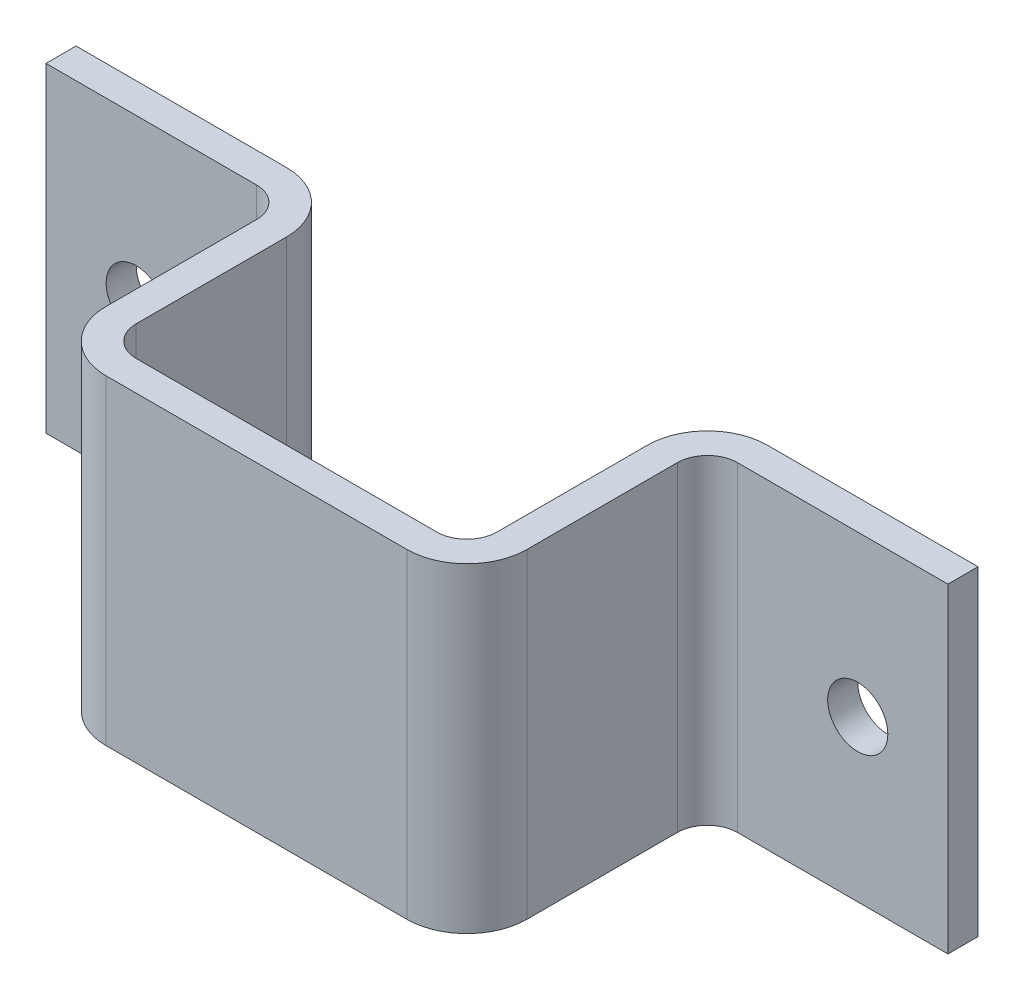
from build123d import *

# Parameters (mm, degrees)
EXTRUDE_THIN1_DEPTH = 26.63484833
SKETCH3_R           = 5
CUT_EXTRUDE1_DEPTH  = 90.075334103
LPATTERN1_COUNT     = 2
LPATTERN1_PITCH     = 120


with BuildPart() as part:
    # Sketch2 → Extrude-Thin1 (new, symmetric)
    with BuildSketch(Plane(origin=(0, 0, 0), x_dir=(-1, 0, 0), z_dir=(0, 1, 0))):
        with BuildLine():
            Line((-75, 0), (-40, 0))
            ThreePointArc((-40, 0), (-32.928932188, 2.928932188), (-30, 10))
            Line((-30, 10), (-30, 35))
            ThreePointArc((-30, 35), (-28.535533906, 38.535533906), (-25, 40))
            Line((-25, 40), (25, 40))
            ThreePointArc((25, 40), (28.535533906, 38.535533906), (30, 35))
            Line((30, 35), (30, 10))
            ThreePointArc((30, 10), (32.928932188, 2.928932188), (40, 0))
            Line((40, 0), (75, 0))
            Line((75, 0), (75, 5))
            Line((75, 5), (40, 5))
            ThreePointArc((40, 5), (36.464466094, 6.464466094), (35, 10))
            Line((35, 10), (35, 35))
            ThreePointArc((35, 35), (32.071067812, 42.071067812), (25, 45))
            Line((25, 45), (-25, 45))
            ThreePointArc((-25, 45), (-32.071067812, 42.071067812), (-35, 35))
            Line((-35, 35), (-35, 10))
            ThreePointArc((-35, 10), (-36.464466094, 6.464466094), (-40, 5))
            Line((-40, 5), (-75, 5))
            Line((-75, 5), (-75, 0))
        make_face()
    extrude(amount=EXTRUDE_THIN1_DEPTH, both=True)

    # Sketch3 → Cut-Extrude1 (cut, through all)
    with BuildSketch(Plane.XY.offset(5)):
        with Locations((60, 0)):
            Circle(SKETCH3_R)
    cut_extrude1 = extrude(amount=-CUT_EXTRUDE1_DEPTH, mode=Mode.SUBTRACT)

    # LPattern1: Cut-Extrude1 ×2
    with Locations(*[(-i * LPATTERN1_PITCH, 0, 0) for i in range(1, LPATTERN1_COUNT)]):
        add(cut_extrude1, mode=Mode.SUBTRACT)


solid = part.part
